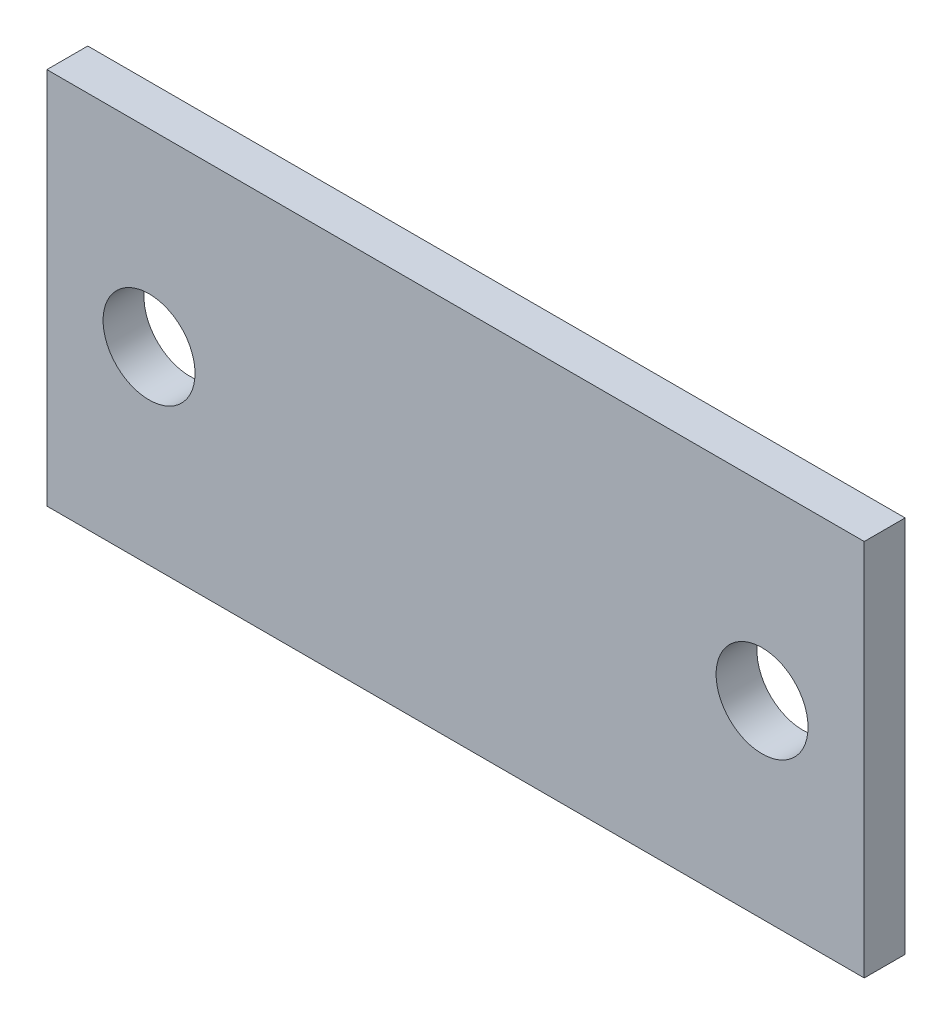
ISO-10303-21;
HEADER;
FILE_DESCRIPTION(('STEP AP214'),'2;1');
FILE_NAME('part.step','',(''),(''),'','','');
FILE_SCHEMA(('AUTOMOTIVE_DESIGN { 1 0 10303 214 1 1 1 1 }'));
ENDSEC;
DATA;
#1=APPLICATION_CONTEXT('core data for automotive mechanical design processes');
#2=APPLICATION_PROTOCOL_DEFINITION('international standard','automotive_design',2000,#1);
#3=PRODUCT_CONTEXT('',#1,'mechanical');
#4=PRODUCT('Part','Part','',(#3));
#5=PRODUCT_RELATED_PRODUCT_CATEGORY('part','',(#4));
#6=PRODUCT_DEFINITION_FORMATION('','',#4);
#7=PRODUCT_DEFINITION_CONTEXT('part definition',#1,'design');
#8=PRODUCT_DEFINITION('design','',#6,#7);
#9=PRODUCT_DEFINITION_SHAPE('','',#8);
#10=(LENGTH_UNIT() NAMED_UNIT(*) SI_UNIT(.MILLI.,.METRE.));
#11=(NAMED_UNIT(*) PLANE_ANGLE_UNIT() SI_UNIT($,.RADIAN.));
#12=(NAMED_UNIT(*) SI_UNIT($,.STERADIAN.) SOLID_ANGLE_UNIT());
#13=UNCERTAINTY_MEASURE_WITH_UNIT(LENGTH_MEASURE(1.E-05),#10,'distance_accuracy_value','');
#14=(GEOMETRIC_REPRESENTATION_CONTEXT(3) GLOBAL_UNCERTAINTY_ASSIGNED_CONTEXT((#13)) GLOBAL_UNIT_ASSIGNED_CONTEXT((#10,
#11,#12)) REPRESENTATION_CONTEXT('',''));
#15=CARTESIAN_POINT('',(0.,0.,0.));
#16=DIRECTION('',(0.,0.,1.));
#17=DIRECTION('',(1.,0.,0.));
#18=AXIS2_PLACEMENT_3D('',#15,#16,#17);
#19=CARTESIAN_POINT('',(215.000000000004,-18.5000000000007,3.99999999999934));
#20=DIRECTION('',(0.,0.,1.));
#21=DIRECTION('',(1.00000000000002,0.,0.));
#22=AXIS2_PLACEMENT_3D('',#19,#20,#21);
#23=PLANE('',#22);
#24=CARTESIAN_POINT('',(205.000000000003,-1.66533453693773E-12,4.00000000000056));
#25=DIRECTION('',(0.,0.,1.));
#26=DIRECTION('',(1.00000000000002,0.,0.));
#27=AXIS2_PLACEMENT_3D('',#24,#25,#26);
#28=CIRCLE('',#27,4.49999999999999);
#29=CARTESIAN_POINT('',(209.500000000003,-1.66733293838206E-12,4.00000000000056));
#30=VERTEX_POINT('',#29);
#31=EDGE_CURVE('E87',#30,#30,#28,.T.);
#32=ORIENTED_EDGE('',*,*,#31,.F.);
#33=EDGE_LOOP('',(#32));
#34=FACE_BOUND('',#33,.T.);
#35=DIRECTION('',(1.00000000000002,0.,0.));
#36=VECTOR('',#35,1.);
#37=CARTESIAN_POINT('',(135.000000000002,-18.500000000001,4.000000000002));
#38=LINE('',#37,#36);
#39=CARTESIAN_POINT('',(135.000000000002,-18.500000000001,4.000000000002));
#40=VERTEX_POINT('',#39);
#41=CARTESIAN_POINT('',(215.000000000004,-18.5000000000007,3.99999999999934));
#42=VERTEX_POINT('',#41);
#43=EDGE_CURVE('E97',#40,#42,#38,.T.);
#44=ORIENTED_EDGE('',*,*,#43,.T.);
#45=DIRECTION('',(0.,1.00000000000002,0.));
#46=VECTOR('',#45,1.);
#47=CARTESIAN_POINT('',(215.000000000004,-18.5000000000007,3.99999999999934));
#48=LINE('',#47,#46);
#49=CARTESIAN_POINT('',(215.000000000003,18.5000000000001,4.000000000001));
#50=VERTEX_POINT('',#49);
#51=EDGE_CURVE('E82',#42,#50,#48,.T.);
#52=ORIENTED_EDGE('',*,*,#51,.T.);
#53=DIRECTION('',(-1.00000000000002,0.,0.));
#54=VECTOR('',#53,1.);
#55=CARTESIAN_POINT('',(215.000000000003,18.5000000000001,4.000000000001));
#56=LINE('',#55,#54);
#57=CARTESIAN_POINT('',(135.000000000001,18.4999999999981,4.00000000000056));
#58=VERTEX_POINT('',#57);
#59=EDGE_CURVE('E48',#50,#58,#56,.T.);
#60=ORIENTED_EDGE('',*,*,#59,.T.);
#61=DIRECTION('',(0.,-1.00000000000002,0.));
#62=VECTOR('',#61,1.);
#63=CARTESIAN_POINT('',(135.000000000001,18.4999999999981,4.00000000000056));
#64=LINE('',#63,#62);
#65=EDGE_CURVE('E43',#58,#40,#64,.T.);
#66=ORIENTED_EDGE('',*,*,#65,.T.);
#67=EDGE_LOOP('',(#44,#52,#60,#66));
#68=FACE_BOUND('',#67,.T.);
#69=CARTESIAN_POINT('',(145.000000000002,-1.55431223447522E-12,3.99999999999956));
#70=DIRECTION('',(0.,0.,1.));
#71=DIRECTION('',(1.00000000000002,0.,0.));
#72=AXIS2_PLACEMENT_3D('',#69,#70,#71);
#73=CIRCLE('',#72,4.49999999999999);
#74=CARTESIAN_POINT('',(149.500000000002,-1.55631063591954E-12,3.99999999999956));
#75=VERTEX_POINT('',#74);
#76=EDGE_CURVE('E115',#75,#75,#73,.T.);
#77=ORIENTED_EDGE('',*,*,#76,.F.);
#78=EDGE_LOOP('',(#77));
#79=FACE_BOUND('',#78,.T.);
#80=ADVANCED_FACE('F28',(#34,#68,#79),#23,.T.);
#81=CARTESIAN_POINT('',(215.000000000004,-18.5000000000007,-6.66133814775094E-13));
#82=DIRECTION('',(0.,0.,1.));
#83=DIRECTION('',(1.00000000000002,0.,0.));
#84=AXIS2_PLACEMENT_3D('',#81,#82,#83);
#85=PLANE('',#84);
#86=CARTESIAN_POINT('',(205.000000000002,-1.4432899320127E-12,5.55111512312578E-13));
#87=DIRECTION('',(0.,0.,1.));
#88=DIRECTION('',(1.00000000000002,0.,0.));
#89=AXIS2_PLACEMENT_3D('',#86,#87,#88);
#90=CIRCLE('',#89,4.49999999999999);
#91=CARTESIAN_POINT('',(209.500000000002,-1.44528833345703E-12,5.55111512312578E-13));
#92=VERTEX_POINT('',#91);
#93=EDGE_CURVE('E90',#92,#92,#90,.T.);
#94=ORIENTED_EDGE('',*,*,#93,.T.);
#95=EDGE_LOOP('',(#94));
#96=FACE_BOUND('',#95,.T.);
#97=DIRECTION('',(1.00000000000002,0.,0.));
#98=VECTOR('',#97,1.);
#99=CARTESIAN_POINT('',(135.000000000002,-18.500000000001,1.99840144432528E-12));
#100=LINE('',#99,#98);
#101=CARTESIAN_POINT('',(135.000000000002,-18.500000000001,1.99840144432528E-12));
#102=VERTEX_POINT('',#101);
#103=CARTESIAN_POINT('',(215.000000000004,-18.5000000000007,-6.66133814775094E-13));
#104=VERTEX_POINT('',#103);
#105=EDGE_CURVE('E74',#102,#104,#100,.T.);
#106=ORIENTED_EDGE('',*,*,#105,.F.);
#107=DIRECTION('',(0.,-1.00000000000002,0.));
#108=VECTOR('',#107,1.);
#109=CARTESIAN_POINT('',(135.000000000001,18.4999999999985,5.55111512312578E-13));
#110=LINE('',#109,#108);
#111=CARTESIAN_POINT('',(135.000000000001,18.4999999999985,5.55111512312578E-13));
#112=VERTEX_POINT('',#111);
#113=EDGE_CURVE('E95',#112,#102,#110,.T.);
#114=ORIENTED_EDGE('',*,*,#113,.F.);
#115=DIRECTION('',(-1.00000000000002,0.,0.));
#116=VECTOR('',#115,1.);
#117=CARTESIAN_POINT('',(215.000000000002,18.4999999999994,9.99200722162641E-13));
#118=LINE('',#117,#116);
#119=CARTESIAN_POINT('',(215.000000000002,18.4999999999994,9.99200722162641E-13));
#120=VERTEX_POINT('',#119);
#121=EDGE_CURVE('E75',#120,#112,#118,.T.);
#122=ORIENTED_EDGE('',*,*,#121,.F.);
#123=DIRECTION('',(0.,1.00000000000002,0.));
#124=VECTOR('',#123,1.);
#125=CARTESIAN_POINT('',(215.000000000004,-18.5000000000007,-6.66133814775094E-13));
#126=LINE('',#125,#124);
#127=EDGE_CURVE('E69',#104,#120,#126,.T.);
#128=ORIENTED_EDGE('',*,*,#127,.F.);
#129=EDGE_LOOP('',(#106,#114,#122,#128));
#130=FACE_BOUND('',#129,.T.);
#131=CARTESIAN_POINT('',(145.000000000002,-1.55431223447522E-12,-4.44089209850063E-13));
#132=DIRECTION('',(0.,0.,1.));
#133=DIRECTION('',(1.00000000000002,0.,0.));
#134=AXIS2_PLACEMENT_3D('',#131,#132,#133);
#135=CIRCLE('',#134,4.49999999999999);
#136=CARTESIAN_POINT('',(149.500000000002,-1.55631063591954E-12,-4.44089209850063E-13));
#137=VERTEX_POINT('',#136);
#138=EDGE_CURVE('E117',#137,#137,#135,.T.);
#139=ORIENTED_EDGE('',*,*,#138,.T.);
#140=EDGE_LOOP('',(#139));
#141=FACE_BOUND('',#140,.T.);
#142=ADVANCED_FACE('F70',(#96,#130,#141),#85,.F.);
#143=CARTESIAN_POINT('',(135.000000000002,-18.500000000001,4.000000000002));
#144=DIRECTION('',(0.,1.00000000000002,0.));
#145=DIRECTION('',(-1.00000000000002,0.,0.));
#146=AXIS2_PLACEMENT_3D('',#143,#144,#145);
#147=PLANE('',#146);
#148=ORIENTED_EDGE('',*,*,#105,.T.);
#149=DIRECTION('',(0.,0.,-1.));
#150=VECTOR('',#149,1.);
#151=CARTESIAN_POINT('',(215.000000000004,-18.5000000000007,3.99999999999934));
#152=LINE('',#151,#150);
#153=EDGE_CURVE('E11',#42,#104,#152,.T.);
#154=ORIENTED_EDGE('',*,*,#153,.F.);
#155=ORIENTED_EDGE('',*,*,#43,.F.);
#156=DIRECTION('',(0.,0.,-1.));
#157=VECTOR('',#156,1.);
#158=CARTESIAN_POINT('',(135.000000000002,-18.500000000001,4.000000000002));
#159=LINE('',#158,#157);
#160=EDGE_CURVE('E86',#40,#102,#159,.T.);
#161=ORIENTED_EDGE('',*,*,#160,.T.);
#162=EDGE_LOOP('',(#148,#154,#155,#161));
#163=FACE_BOUND('',#162,.T.);
#164=ADVANCED_FACE('F30',(#163),#147,.F.);
#165=CARTESIAN_POINT('',(215.000000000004,-18.5000000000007,3.99999999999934));
#166=DIRECTION('',(-1.00000000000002,0.,0.));
#167=DIRECTION('',(0.,-1.00000000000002,0.));
#168=AXIS2_PLACEMENT_3D('',#165,#166,#167);
#169=PLANE('',#168);
#170=ORIENTED_EDGE('',*,*,#127,.T.);
#171=DIRECTION('',(0.,0.,-1.));
#172=VECTOR('',#171,1.);
#173=CARTESIAN_POINT('',(215.000000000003,18.5000000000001,4.000000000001));
#174=LINE('',#173,#172);
#175=EDGE_CURVE('E36',#50,#120,#174,.T.);
#176=ORIENTED_EDGE('',*,*,#175,.F.);
#177=ORIENTED_EDGE('',*,*,#51,.F.);
#178=ORIENTED_EDGE('',*,*,#153,.T.);
#179=EDGE_LOOP('',(#170,#176,#177,#178));
#180=FACE_BOUND('',#179,.T.);
#181=ADVANCED_FACE('F81',(#180),#169,.F.);
#182=CARTESIAN_POINT('',(215.000000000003,18.5000000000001,4.000000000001));
#183=DIRECTION('',(0.,-1.00000000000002,0.));
#184=DIRECTION('',(1.00000000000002,0.,0.));
#185=AXIS2_PLACEMENT_3D('',#182,#183,#184);
#186=PLANE('',#185);
#187=ORIENTED_EDGE('',*,*,#121,.T.);
#188=DIRECTION('',(0.,0.,-1.));
#189=VECTOR('',#188,1.);
#190=CARTESIAN_POINT('',(135.000000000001,18.4999999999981,4.00000000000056));
#191=LINE('',#190,#189);
#192=EDGE_CURVE('E103',#58,#112,#191,.T.);
#193=ORIENTED_EDGE('',*,*,#192,.F.);
#194=ORIENTED_EDGE('',*,*,#59,.F.);
#195=ORIENTED_EDGE('',*,*,#175,.T.);
#196=EDGE_LOOP('',(#187,#193,#194,#195));
#197=FACE_BOUND('',#196,.T.);
#198=ADVANCED_FACE('F106',(#197),#186,.F.);
#199=CARTESIAN_POINT('',(135.000000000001,18.4999999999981,4.00000000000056));
#200=DIRECTION('',(1.00000000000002,0.,0.));
#201=DIRECTION('',(0.,1.00000000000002,0.));
#202=AXIS2_PLACEMENT_3D('',#199,#200,#201);
#203=PLANE('',#202);
#204=ORIENTED_EDGE('',*,*,#113,.T.);
#205=ORIENTED_EDGE('',*,*,#160,.F.);
#206=ORIENTED_EDGE('',*,*,#65,.F.);
#207=ORIENTED_EDGE('',*,*,#192,.T.);
#208=EDGE_LOOP('',(#204,#205,#206,#207));
#209=FACE_BOUND('',#208,.T.);
#210=ADVANCED_FACE('F108',(#209),#203,.F.);
#211=CARTESIAN_POINT('',(205.000000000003,-1.66533453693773E-12,4.00000000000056));
#212=DIRECTION('',(0.,0.,-1.));
#213=DIRECTION('',(-1.00000000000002,0.,0.));
#214=AXIS2_PLACEMENT_3D('',#211,#212,#213);
#215=CYLINDRICAL_SURFACE('',#214,4.49999999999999);
#216=ORIENTED_EDGE('',*,*,#31,.T.);
#217=EDGE_LOOP('',(#216));
#218=FACE_BOUND('',#217,.T.);
#219=ORIENTED_EDGE('',*,*,#93,.F.);
#220=EDGE_LOOP('',(#219));
#221=FACE_BOUND('',#220,.T.);
#222=ADVANCED_FACE('F126',(#218,#221),#215,.F.);
#223=CARTESIAN_POINT('',(145.000000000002,-1.55431223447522E-12,3.99999999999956));
#224=DIRECTION('',(0.,0.,-1.));
#225=DIRECTION('',(-1.00000000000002,0.,0.));
#226=AXIS2_PLACEMENT_3D('',#223,#224,#225);
#227=CYLINDRICAL_SURFACE('',#226,4.49999999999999);
#228=ORIENTED_EDGE('',*,*,#76,.T.);
#229=EDGE_LOOP('',(#228));
#230=FACE_BOUND('',#229,.T.);
#231=ORIENTED_EDGE('',*,*,#138,.F.);
#232=EDGE_LOOP('',(#231));
#233=FACE_BOUND('',#232,.T.);
#234=ADVANCED_FACE('F124',(#230,#233),#227,.F.);
#235=CLOSED_SHELL('',(#80,#142,#164,#181,#198,#210,#222,#234));
#236=MANIFOLD_SOLID_BREP('B2',#235);
#237=ADVANCED_BREP_SHAPE_REPRESENTATION('',(#18,#236),#14);
#238=SHAPE_DEFINITION_REPRESENTATION(#9,#237);
ENDSEC;
END-ISO-10303-21;
